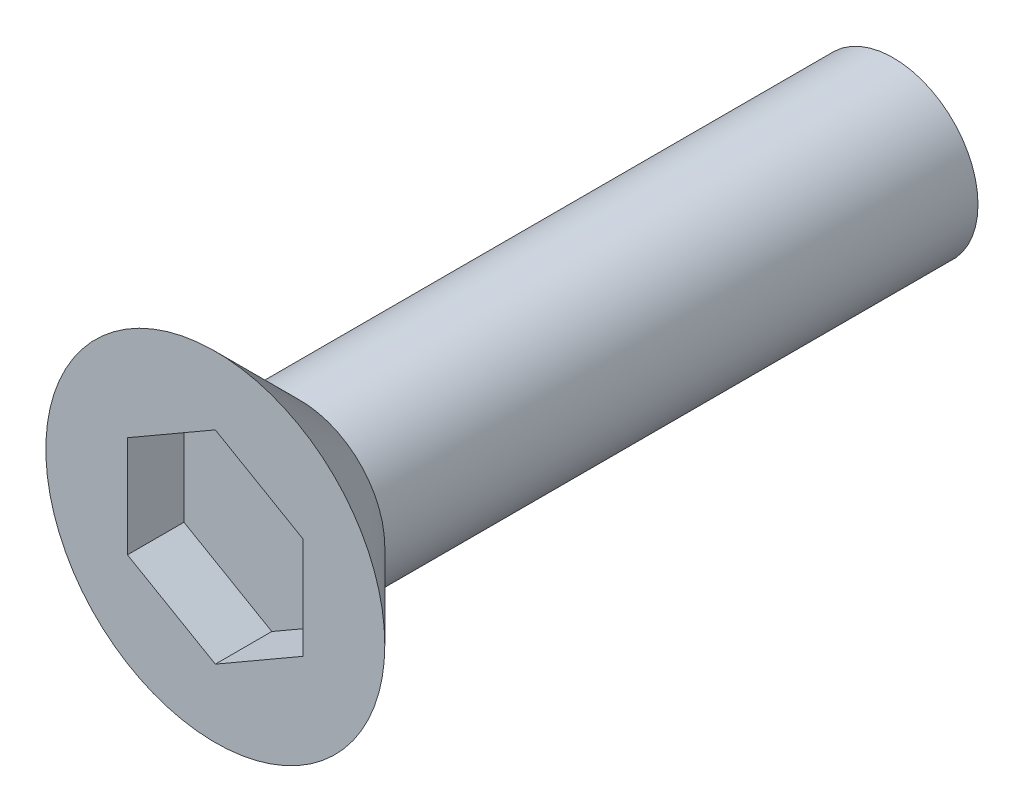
ISO-10303-21;
HEADER;
FILE_DESCRIPTION(('STEP AP214'),'2;1');
FILE_NAME('part.step','',(''),(''),'','','');
FILE_SCHEMA(('AUTOMOTIVE_DESIGN { 1 0 10303 214 1 1 1 1 }'));
ENDSEC;
DATA;
#1=APPLICATION_CONTEXT('core data for automotive mechanical design processes');
#2=APPLICATION_PROTOCOL_DEFINITION('international standard','automotive_design',2000,#1);
#3=PRODUCT_CONTEXT('',#1,'mechanical');
#4=PRODUCT('Part','Part','',(#3));
#5=PRODUCT_RELATED_PRODUCT_CATEGORY('part','',(#4));
#6=PRODUCT_DEFINITION_FORMATION('','',#4);
#7=PRODUCT_DEFINITION_CONTEXT('part definition',#1,'design');
#8=PRODUCT_DEFINITION('design','',#6,#7);
#9=PRODUCT_DEFINITION_SHAPE('','',#8);
#10=(LENGTH_UNIT() NAMED_UNIT(*) SI_UNIT(.MILLI.,.METRE.));
#11=(NAMED_UNIT(*) PLANE_ANGLE_UNIT() SI_UNIT($,.RADIAN.));
#12=(NAMED_UNIT(*) SI_UNIT($,.STERADIAN.) SOLID_ANGLE_UNIT());
#13=UNCERTAINTY_MEASURE_WITH_UNIT(LENGTH_MEASURE(1.E-05),#10,'distance_accuracy_value','');
#14=(GEOMETRIC_REPRESENTATION_CONTEXT(3) GLOBAL_UNCERTAINTY_ASSIGNED_CONTEXT((#13)) GLOBAL_UNIT_ASSIGNED_CONTEXT((#10,
#11,#12)) REPRESENTATION_CONTEXT('',''));
#15=CARTESIAN_POINT('',(0.,0.,0.));
#16=DIRECTION('',(0.,0.,1.));
#17=DIRECTION('',(1.,0.,0.));
#18=AXIS2_PLACEMENT_3D('',#15,#16,#17);
#19=CARTESIAN_POINT('',(0.,0.,10.25));
#20=DIRECTION('',(0.,0.,-1.));
#21=DIRECTION('',(-1.,0.,0.));
#22=AXIS2_PLACEMENT_3D('',#19,#20,#21);
#23=CYLINDRICAL_SURFACE('',#22,1.5);
#24=CARTESIAN_POINT('',(0.,0.,0.));
#25=DIRECTION('',(0.,0.,1.));
#26=DIRECTION('',(1.,0.,0.));
#27=AXIS2_PLACEMENT_3D('',#24,#25,#26);
#28=CIRCLE('',#27,1.5);
#29=CARTESIAN_POINT('',(1.5,0.,0.));
#30=VERTEX_POINT('',#29);
#31=EDGE_CURVE('E21',#30,#30,#28,.F.);
#32=ORIENTED_EDGE('',*,*,#31,.F.);
#33=EDGE_LOOP('',(#32));
#34=FACE_BOUND('',#33,.T.);
#35=CARTESIAN_POINT('',(0.,0.,10.5));
#36=DIRECTION('',(0.,0.,1.));
#37=DIRECTION('',(1.,0.,0.));
#38=AXIS2_PLACEMENT_3D('',#35,#36,#37);
#39=CIRCLE('',#38,1.5);
#40=CARTESIAN_POINT('',(1.5,0.,10.5));
#41=VERTEX_POINT('',#40);
#42=EDGE_CURVE('E11',#41,#41,#39,.F.);
#43=ORIENTED_EDGE('',*,*,#42,.T.);
#44=EDGE_LOOP('',(#43));
#45=FACE_BOUND('',#44,.T.);
#46=ADVANCED_FACE('F17',(#34,#45),#23,.T.);
#47=CARTESIAN_POINT('',(0.,0.,12.));
#48=DIRECTION('',(0.,0.,-1.));
#49=DIRECTION('',(-1.,0.,0.));
#50=AXIS2_PLACEMENT_3D('',#47,#48,#49);
#51=PLANE('',#50);
#52=DIRECTION('',(-0.866025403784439,0.5,0.));
#53=VECTOR('',#52,1.);
#54=CARTESIAN_POINT('',(1.555,0.897779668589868,12.));
#55=LINE('',#54,#53);
#56=CARTESIAN_POINT('',(1.555,0.897779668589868,12.));
#57=VERTEX_POINT('',#56);
#58=CARTESIAN_POINT('',(0.,1.79555933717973,12.));
#59=VERTEX_POINT('',#58);
#60=EDGE_CURVE('E107',#57,#59,#55,.T.);
#61=ORIENTED_EDGE('',*,*,#60,.F.);
#62=DIRECTION('',(0.,1.,0.));
#63=VECTOR('',#62,1.);
#64=CARTESIAN_POINT('',(1.555,-0.897779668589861,12.));
#65=LINE('',#64,#63);
#66=CARTESIAN_POINT('',(1.555,-0.897779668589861,12.));
#67=VERTEX_POINT('',#66);
#68=EDGE_CURVE('E112',#67,#57,#65,.T.);
#69=ORIENTED_EDGE('',*,*,#68,.F.);
#70=DIRECTION('',(0.866025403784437,0.5,0.));
#71=VECTOR('',#70,1.);
#72=CARTESIAN_POINT('',(0.,-1.79555933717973,12.));
#73=LINE('',#72,#71);
#74=CARTESIAN_POINT('',(0.,-1.79555933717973,12.));
#75=VERTEX_POINT('',#74);
#76=EDGE_CURVE('E106',#75,#67,#73,.T.);
#77=ORIENTED_EDGE('',*,*,#76,.F.);
#78=DIRECTION('',(0.86602540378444,-0.5,0.));
#79=VECTOR('',#78,1.);
#80=CARTESIAN_POINT('',(-1.555,-0.897779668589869,12.));
#81=LINE('',#80,#79);
#82=CARTESIAN_POINT('',(-1.555,-0.897779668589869,12.));
#83=VERTEX_POINT('',#82);
#84=EDGE_CURVE('E33',#83,#75,#81,.T.);
#85=ORIENTED_EDGE('',*,*,#84,.F.);
#86=DIRECTION('',(0.,-1.,0.));
#87=VECTOR('',#86,1.);
#88=CARTESIAN_POINT('',(-1.555,0.897779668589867,12.));
#89=LINE('',#88,#87);
#90=CARTESIAN_POINT('',(-1.555,0.897779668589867,12.));
#91=VERTEX_POINT('',#90);
#92=EDGE_CURVE('E82',#91,#83,#89,.T.);
#93=ORIENTED_EDGE('',*,*,#92,.F.);
#94=DIRECTION('',(-0.866025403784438,-0.5,0.));
#95=VECTOR('',#94,1.);
#96=CARTESIAN_POINT('',(0.,1.79555933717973,12.));
#97=LINE('',#96,#95);
#98=EDGE_CURVE('E111',#59,#91,#97,.T.);
#99=ORIENTED_EDGE('',*,*,#98,.F.);
#100=EDGE_LOOP('',(#61,#69,#77,#85,#93,#99));
#101=FACE_BOUND('',#100,.T.);
#102=CARTESIAN_POINT('',(0.,0.,12.));
#103=DIRECTION('',(0.,0.,-1.));
#104=DIRECTION('',(1.,0.,0.));
#105=AXIS2_PLACEMENT_3D('',#102,#103,#104);
#106=CIRCLE('',#105,3.);
#107=CARTESIAN_POINT('',(3.,0.,12.));
#108=VERTEX_POINT('',#107);
#109=EDGE_CURVE('E26',#108,#108,#106,.T.);
#110=ORIENTED_EDGE('',*,*,#109,.F.);
#111=EDGE_LOOP('',(#110));
#112=FACE_BOUND('',#111,.T.);
#113=ADVANCED_FACE('F135',(#101,#112),#51,.F.);
#114=CARTESIAN_POINT('',(0.,0.,10.25));
#115=DIRECTION('',(0.,0.,1.));
#116=DIRECTION('',(1.,0.,0.));
#117=AXIS2_PLACEMENT_3D('',#114,#115,#116);
#118=CONICAL_SURFACE('',#117,1.25,0.785398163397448);
#119=ORIENTED_EDGE('',*,*,#109,.T.);
#120=EDGE_LOOP('',(#119));
#121=FACE_BOUND('',#120,.T.);
#122=ORIENTED_EDGE('',*,*,#42,.F.);
#123=EDGE_LOOP('',(#122));
#124=FACE_BOUND('',#123,.T.);
#125=ADVANCED_FACE('F19',(#121,#124),#118,.T.);
#126=CARTESIAN_POINT('',(1.555,-0.897779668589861,11.));
#127=DIRECTION('',(1.,0.,0.));
#128=DIRECTION('',(0.,1.,0.));
#129=AXIS2_PLACEMENT_3D('',#126,#127,#128);
#130=PLANE('',#129);
#131=ORIENTED_EDGE('',*,*,#68,.T.);
#132=DIRECTION('',(0.,0.,1.));
#133=VECTOR('',#132,1.);
#134=CARTESIAN_POINT('',(1.555,0.897779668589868,11.));
#135=LINE('',#134,#133);
#136=CARTESIAN_POINT('',(1.555,0.897779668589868,11.));
#137=VERTEX_POINT('',#136);
#138=EDGE_CURVE('E66',#137,#57,#135,.T.);
#139=ORIENTED_EDGE('',*,*,#138,.F.);
#140=DIRECTION('',(0.,1.,0.));
#141=VECTOR('',#140,1.);
#142=CARTESIAN_POINT('',(1.555,-0.897779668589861,11.));
#143=LINE('',#142,#141);
#144=CARTESIAN_POINT('',(1.555,-0.897779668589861,11.));
#145=VERTEX_POINT('',#144);
#146=EDGE_CURVE('E103',#145,#137,#143,.T.);
#147=ORIENTED_EDGE('',*,*,#146,.F.);
#148=DIRECTION('',(0.,0.,1.));
#149=VECTOR('',#148,1.);
#150=CARTESIAN_POINT('',(1.555,-0.897779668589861,11.));
#151=LINE('',#150,#149);
#152=EDGE_CURVE('E42',#145,#67,#151,.T.);
#153=ORIENTED_EDGE('',*,*,#152,.T.);
#154=EDGE_LOOP('',(#131,#139,#147,#153));
#155=FACE_BOUND('',#154,.T.);
#156=ADVANCED_FACE('F145',(#155),#130,.F.);
#157=CARTESIAN_POINT('',(1.555,0.897779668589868,11.));
#158=DIRECTION('',(0.5,0.866025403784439,0.));
#159=DIRECTION('',(-0.866025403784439,0.5,0.));
#160=AXIS2_PLACEMENT_3D('',#157,#158,#159);
#161=PLANE('',#160);
#162=ORIENTED_EDGE('',*,*,#60,.T.);
#163=DIRECTION('',(0.,0.,1.));
#164=VECTOR('',#163,1.);
#165=CARTESIAN_POINT('',(0.,1.79555933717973,11.));
#166=LINE('',#165,#164);
#167=CARTESIAN_POINT('',(0.,1.79555933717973,11.));
#168=VERTEX_POINT('',#167);
#169=EDGE_CURVE('E127',#168,#59,#166,.T.);
#170=ORIENTED_EDGE('',*,*,#169,.F.);
#171=DIRECTION('',(-0.866025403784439,0.5,0.));
#172=VECTOR('',#171,1.);
#173=CARTESIAN_POINT('',(1.555,0.897779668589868,11.));
#174=LINE('',#173,#172);
#175=EDGE_CURVE('E105',#137,#168,#174,.T.);
#176=ORIENTED_EDGE('',*,*,#175,.F.);
#177=ORIENTED_EDGE('',*,*,#138,.T.);
#178=EDGE_LOOP('',(#162,#170,#176,#177));
#179=FACE_BOUND('',#178,.T.);
#180=ADVANCED_FACE('F151',(#179),#161,.F.);
#181=CARTESIAN_POINT('',(0.,1.79555933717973,11.));
#182=DIRECTION('',(-0.5,0.866025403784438,0.));
#183=DIRECTION('',(-0.866025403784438,-0.5,0.));
#184=AXIS2_PLACEMENT_3D('',#181,#182,#183);
#185=PLANE('',#184);
#186=ORIENTED_EDGE('',*,*,#98,.T.);
#187=DIRECTION('',(0.,0.,1.));
#188=VECTOR('',#187,1.);
#189=CARTESIAN_POINT('',(-1.555,0.897779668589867,11.));
#190=LINE('',#189,#188);
#191=CARTESIAN_POINT('',(-1.555,0.897779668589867,11.));
#192=VERTEX_POINT('',#191);
#193=EDGE_CURVE('E84',#192,#91,#190,.T.);
#194=ORIENTED_EDGE('',*,*,#193,.F.);
#195=DIRECTION('',(-0.866025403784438,-0.5,0.));
#196=VECTOR('',#195,1.);
#197=CARTESIAN_POINT('',(0.,1.79555933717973,11.));
#198=LINE('',#197,#196);
#199=EDGE_CURVE('E95',#168,#192,#198,.T.);
#200=ORIENTED_EDGE('',*,*,#199,.F.);
#201=ORIENTED_EDGE('',*,*,#169,.T.);
#202=EDGE_LOOP('',(#186,#194,#200,#201));
#203=FACE_BOUND('',#202,.T.);
#204=ADVANCED_FACE('F154',(#203),#185,.F.);
#205=CARTESIAN_POINT('',(-1.555,0.897779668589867,11.));
#206=DIRECTION('',(-1.,0.,0.));
#207=DIRECTION('',(0.,-1.,0.));
#208=AXIS2_PLACEMENT_3D('',#205,#206,#207);
#209=PLANE('',#208);
#210=ORIENTED_EDGE('',*,*,#92,.T.);
#211=DIRECTION('',(0.,0.,1.));
#212=VECTOR('',#211,1.);
#213=CARTESIAN_POINT('',(-1.555,-0.897779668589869,11.));
#214=LINE('',#213,#212);
#215=CARTESIAN_POINT('',(-1.555,-0.897779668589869,11.));
#216=VERTEX_POINT('',#215);
#217=EDGE_CURVE('E77',#216,#83,#214,.T.);
#218=ORIENTED_EDGE('',*,*,#217,.F.);
#219=DIRECTION('',(0.,-1.,0.));
#220=VECTOR('',#219,1.);
#221=CARTESIAN_POINT('',(-1.555,0.897779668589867,11.));
#222=LINE('',#221,#220);
#223=EDGE_CURVE('E80',#192,#216,#222,.T.);
#224=ORIENTED_EDGE('',*,*,#223,.F.);
#225=ORIENTED_EDGE('',*,*,#193,.T.);
#226=EDGE_LOOP('',(#210,#218,#224,#225));
#227=FACE_BOUND('',#226,.T.);
#228=ADVANCED_FACE('F79',(#227),#209,.F.);
#229=CARTESIAN_POINT('',(-1.555,-0.897779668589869,11.));
#230=DIRECTION('',(-0.5,-0.86602540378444,0.));
#231=DIRECTION('',(0.86602540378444,-0.5,0.));
#232=AXIS2_PLACEMENT_3D('',#229,#230,#231);
#233=PLANE('',#232);
#234=ORIENTED_EDGE('',*,*,#84,.T.);
#235=DIRECTION('',(0.,0.,1.));
#236=VECTOR('',#235,1.);
#237=CARTESIAN_POINT('',(0.,-1.79555933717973,11.));
#238=LINE('',#237,#236);
#239=CARTESIAN_POINT('',(0.,-1.79555933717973,11.));
#240=VERTEX_POINT('',#239);
#241=EDGE_CURVE('E85',#240,#75,#238,.T.);
#242=ORIENTED_EDGE('',*,*,#241,.F.);
#243=DIRECTION('',(0.86602540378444,-0.5,0.));
#244=VECTOR('',#243,1.);
#245=CARTESIAN_POINT('',(-1.555,-0.897779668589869,11.));
#246=LINE('',#245,#244);
#247=EDGE_CURVE('E92',#216,#240,#246,.T.);
#248=ORIENTED_EDGE('',*,*,#247,.F.);
#249=ORIENTED_EDGE('',*,*,#217,.T.);
#250=EDGE_LOOP('',(#234,#242,#248,#249));
#251=FACE_BOUND('',#250,.T.);
#252=ADVANCED_FACE('F97',(#251),#233,.F.);
#253=CARTESIAN_POINT('',(0.,-1.79555933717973,11.));
#254=DIRECTION('',(0.5,-0.866025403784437,0.));
#255=DIRECTION('',(0.866025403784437,0.5,0.));
#256=AXIS2_PLACEMENT_3D('',#253,#254,#255);
#257=PLANE('',#256);
#258=ORIENTED_EDGE('',*,*,#76,.T.);
#259=ORIENTED_EDGE('',*,*,#152,.F.);
#260=DIRECTION('',(0.866025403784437,0.5,0.));
#261=VECTOR('',#260,1.);
#262=CARTESIAN_POINT('',(0.,-1.79555933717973,11.));
#263=LINE('',#262,#261);
#264=EDGE_CURVE('E98',#240,#145,#263,.T.);
#265=ORIENTED_EDGE('',*,*,#264,.F.);
#266=ORIENTED_EDGE('',*,*,#241,.T.);
#267=EDGE_LOOP('',(#258,#259,#265,#266));
#268=FACE_BOUND('',#267,.T.);
#269=ADVANCED_FACE('F163',(#268),#257,.F.);
#270=CARTESIAN_POINT('',(0.,0.,11.));
#271=DIRECTION('',(0.,0.,1.));
#272=DIRECTION('',(1.,0.,0.));
#273=AXIS2_PLACEMENT_3D('',#270,#271,#272);
#274=PLANE('',#273);
#275=ORIENTED_EDGE('',*,*,#146,.T.);
#276=ORIENTED_EDGE('',*,*,#175,.T.);
#277=ORIENTED_EDGE('',*,*,#199,.T.);
#278=ORIENTED_EDGE('',*,*,#223,.T.);
#279=ORIENTED_EDGE('',*,*,#247,.T.);
#280=ORIENTED_EDGE('',*,*,#264,.T.);
#281=EDGE_LOOP('',(#275,#276,#277,#278,#279,#280));
#282=FACE_BOUND('',#281,.T.);
#283=ADVANCED_FACE('F91',(#282),#274,.T.);
#284=CARTESIAN_POINT('',(0.,0.,0.));
#285=DIRECTION('',(0.,0.,1.));
#286=DIRECTION('',(1.,0.,0.));
#287=AXIS2_PLACEMENT_3D('',#284,#285,#286);
#288=PLANE('',#287);
#289=ORIENTED_EDGE('',*,*,#31,.T.);
#290=EDGE_LOOP('',(#289));
#291=FACE_BOUND('',#290,.T.);
#292=ADVANCED_FACE('F168',(#291),#288,.F.);
#293=CLOSED_SHELL('',(#46,#113,#125,#156,#180,#204,#228,#252,#269,#283,#292));
#294=MANIFOLD_SOLID_BREP('B1',#293);
#295=ADVANCED_BREP_SHAPE_REPRESENTATION('',(#18,#294),#14);
#296=SHAPE_DEFINITION_REPRESENTATION(#9,#295);
ENDSEC;
END-ISO-10303-21;
